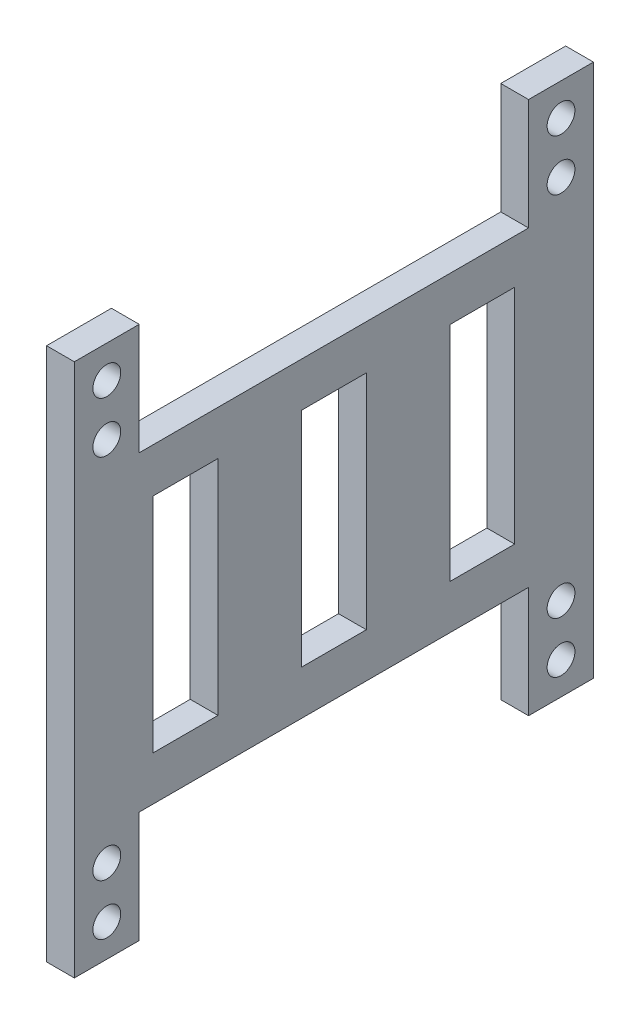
from build123d import *

# Parameters (mm, degrees)
SKETCH2_W           = 7
SKETCH2_H           = 12
SKETCH2_R           = 1.5
BOSS_EXTRUDE1_DEPTH = 3
SKETCH3_W           = 7
SKETCH3_H           = 24
CUT_EXTRUDE1_DEPTH  = 10


with BuildPart() as part:
    # Sketch2 → Boss-Extrude1 (new body)
    # profile 1 of 12: a face of its own
    with BuildSketch(Plane(origin=(0, 0, 0), x_dir=(0, 0, -1), z_dir=(1, 0, 0))):
        with Locations((-24.5, 22.785)):
            Rectangle(SKETCH2_W, SKETCH2_H)
        with Locations((-24.5, 19.785)):
            Circle(SKETCH2_R, mode=Mode.SUBTRACT)
        with Locations((-24.5, 25.285)):
            Circle(SKETCH2_R, mode=Mode.SUBTRACT)
    # profile 2 of 12: a face of its own
    with BuildSketch(Plane(origin=(0, 0, 0), x_dir=(0, 0, -1), z_dir=(1, 0, 0))):
        Polygon((-28, 16.785), (-28, 0), (0, 0), (0, 16.785), (-21, 16.785), align=None)
    # profile 3 of 12: a face of its own
    with BuildSketch(Plane(origin=(0, 0, 0), x_dir=(0, 0, -1), z_dir=(1, 0, 0))):
        Polygon((0, 16.785), (0, 0), (28, 0), (28, 16.785), (21, 16.785), align=None)
    # profile 4 of 12: a face of its own
    with BuildSketch(Plane(origin=(0, 0, 0), x_dir=(0, 0, -1), z_dir=(1, 0, 0))):
        with Locations((24.5, 22.785)):
            Rectangle(SKETCH2_W, SKETCH2_H)
        with Locations((24.5, 19.785)):
            Circle(SKETCH2_R, mode=Mode.SUBTRACT)
        with Locations((24.5, 25.285)):
            Circle(SKETCH2_R, mode=Mode.SUBTRACT)
    # profile 5 of 12: a face of its own
    with BuildSketch(Plane(origin=(0, 0, 0), x_dir=(0, 0, -1), z_dir=(1, 0, 0))):
        Polygon((0, 16.785), (0, 0), (28, 0), (28, 16.785), (21, 16.785), align=None)
    # profile 6 of 12: a face of its own
    with BuildSketch(Plane(origin=(0, 0, 0), x_dir=(0, 0, -1), z_dir=(1, 0, 0))):
        Polygon((-28, 16.785), (-28, 0), (0, 0), (0, 16.785), (-21, 16.785), align=None)
    # profile 7 of 12: a face of its own
    with BuildSketch(Plane(origin=(0, 0, 0), x_dir=(0, 0, -1), z_dir=(1, 0, 0))):
        Polygon((0, 0), (-28, 0), (-28, -16.785), (-21, -16.785), (0, -16.785), align=None)
    # profile 8 of 12: a face of its own
    with BuildSketch(Plane(origin=(0, 0, 0), x_dir=(0, 0, -1), z_dir=(1, 0, 0))):
        Polygon((28, 0), (0, 0), (0, -16.785), (21, -16.785), (28, -16.785), align=None)
    # profile 9 of 12: a face of its own
    with BuildSketch(Plane(origin=(0, 0, 0), x_dir=(0, 0, -1), z_dir=(1, 0, 0))):
        Polygon((0, 0), (-28, 0), (-28, -16.785), (-21, -16.785), (0, -16.785), align=None)
    # profile 10 of 12: a face of its own
    with BuildSketch(Plane(origin=(0, 0, 0), x_dir=(0, 0, -1), z_dir=(1, 0, 0))):
        Polygon((28, 0), (0, 0), (0, -16.785), (21, -16.785), (28, -16.785), align=None)
    # profile 11 of 12: a face of its own
    with BuildSketch(Plane(origin=(0, 0, 0), x_dir=(0, 0, -1), z_dir=(1, 0, 0))):
        with Locations((24.5, -22.785)):
            Rectangle(SKETCH2_W, SKETCH2_H)
        with Locations((24.5, -25.285)):
            Circle(SKETCH2_R, mode=Mode.SUBTRACT)
        with Locations((24.5, -19.785)):
            Circle(SKETCH2_R, mode=Mode.SUBTRACT)
    # profile 12 of 12: a face of its own
    with BuildSketch(Plane(origin=(0, 0, 0), x_dir=(0, 0, -1), z_dir=(1, 0, 0))):
        with Locations((-24.5, -22.785)):
            Rectangle(SKETCH2_W, SKETCH2_H)
        with Locations((-24.5, -25.285)):
            Circle(SKETCH2_R, mode=Mode.SUBTRACT)
        with Locations((-24.5, -19.785)):
            Circle(SKETCH2_R, mode=Mode.SUBTRACT)
    extrude(amount=BOSS_EXTRUDE1_DEPTH)

    # Sketch3 → Cut-Extrude1 (cut)
    with BuildSketch(Plane(origin=(3, 0, 0), x_dir=(0, 0, -1), z_dir=(1, 0, 0))):
        Rectangle(SKETCH3_W, SKETCH3_H)
        with Locations((-16, 0)):
            Rectangle(SKETCH3_W, SKETCH3_H)
        with Locations((16, 0)):
            Rectangle(SKETCH3_W, SKETCH3_H)
    extrude(amount=-CUT_EXTRUDE1_DEPTH, mode=Mode.SUBTRACT)


solid = part.part
